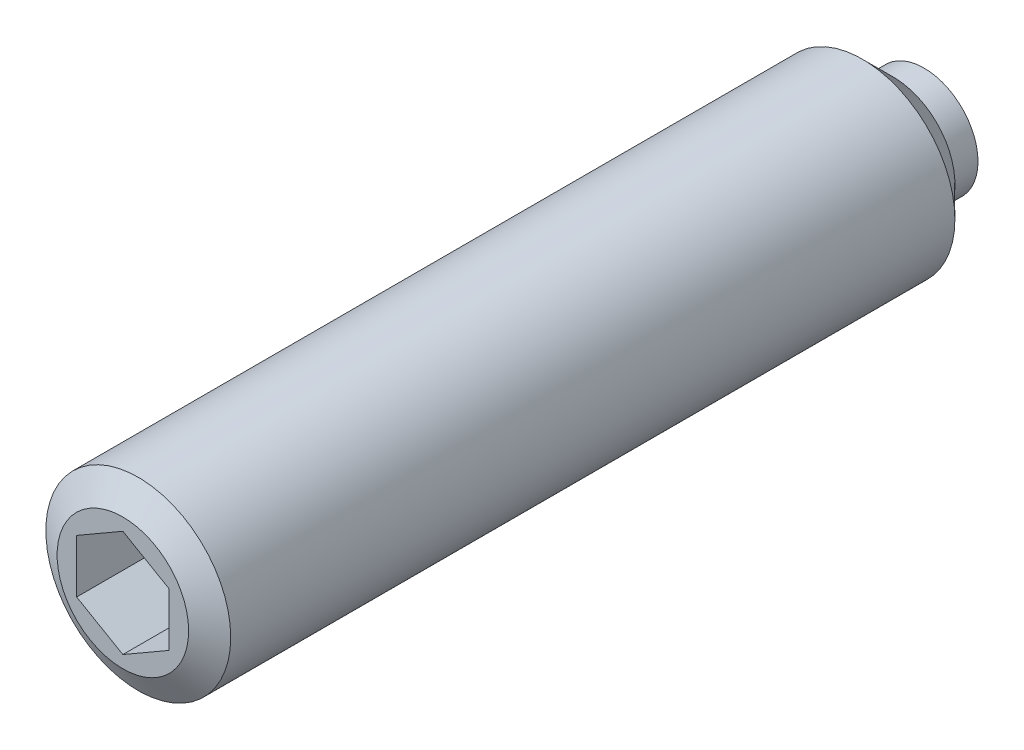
ISO-10303-21;
HEADER;
FILE_DESCRIPTION(('STEP AP214'),'2;1');
FILE_NAME('part.step','',(''),(''),'','','');
FILE_SCHEMA(('AUTOMOTIVE_DESIGN { 1 0 10303 214 1 1 1 1 }'));
ENDSEC;
DATA;
#1=APPLICATION_CONTEXT('core data for automotive mechanical design processes');
#2=APPLICATION_PROTOCOL_DEFINITION('international standard','automotive_design',2000,#1);
#3=PRODUCT_CONTEXT('',#1,'mechanical');
#4=PRODUCT('Part','Part','',(#3));
#5=PRODUCT_RELATED_PRODUCT_CATEGORY('part','',(#4));
#6=PRODUCT_DEFINITION_FORMATION('','',#4);
#7=PRODUCT_DEFINITION_CONTEXT('part definition',#1,'design');
#8=PRODUCT_DEFINITION('design','',#6,#7);
#9=PRODUCT_DEFINITION_SHAPE('','',#8);
#10=(LENGTH_UNIT() NAMED_UNIT(*) SI_UNIT(.MILLI.,.METRE.));
#11=(NAMED_UNIT(*) PLANE_ANGLE_UNIT() SI_UNIT($,.RADIAN.));
#12=(NAMED_UNIT(*) SI_UNIT($,.STERADIAN.) SOLID_ANGLE_UNIT());
#13=UNCERTAINTY_MEASURE_WITH_UNIT(LENGTH_MEASURE(1.E-05),#10,'distance_accuracy_value','');
#14=(GEOMETRIC_REPRESENTATION_CONTEXT(3) GLOBAL_UNCERTAINTY_ASSIGNED_CONTEXT((#13)) GLOBAL_UNIT_ASSIGNED_CONTEXT((#10,
#11,#12)) REPRESENTATION_CONTEXT('',''));
#15=CARTESIAN_POINT('',(0.,0.,0.));
#16=DIRECTION('',(0.,0.,1.));
#17=DIRECTION('',(1.,0.,0.));
#18=AXIS2_PLACEMENT_3D('',#15,#16,#17);
#19=CARTESIAN_POINT('',(3.5,0.,0.));
#20=DIRECTION('',(0.,0.,-1.));
#21=DIRECTION('',(-1.,0.,0.));
#22=AXIS2_PLACEMENT_3D('',#19,#20,#21);
#23=PLANE('',#22);
#24=CARTESIAN_POINT('',(0.,0.,0.));
#25=DIRECTION('',(0.,0.,1.));
#26=DIRECTION('',(1.,0.,0.));
#27=AXIS2_PLACEMENT_3D('',#24,#25,#26);
#28=CIRCLE('',#27,3.5);
#29=CARTESIAN_POINT('',(3.5,0.,0.));
#30=VERTEX_POINT('',#29);
#31=EDGE_CURVE('E124',#30,#30,#28,.T.);
#32=ORIENTED_EDGE('',*,*,#31,.F.);
#33=EDGE_LOOP('',(#32));
#34=FACE_BOUND('',#33,.T.);
#35=ADVANCED_FACE('F14',(#34),#23,.T.);
#36=CARTESIAN_POINT('',(0.,0.,72.));
#37=DIRECTION('',(0.,0.,1.));
#38=DIRECTION('',(1.,0.,0.));
#39=AXIS2_PLACEMENT_3D('',#36,#37,#38);
#40=CYLINDRICAL_SURFACE('',#39,3.5);
#41=CARTESIAN_POINT('',(0.,0.,2.));
#42=DIRECTION('',(0.,0.,1.));
#43=DIRECTION('',(1.,0.,0.));
#44=AXIS2_PLACEMENT_3D('',#41,#42,#43);
#45=CIRCLE('',#44,3.5);
#46=CARTESIAN_POINT('',(3.5,0.,2.));
#47=VERTEX_POINT('',#46);
#48=EDGE_CURVE('E121',#47,#47,#45,.T.);
#49=ORIENTED_EDGE('',*,*,#48,.F.);
#50=EDGE_LOOP('',(#49));
#51=FACE_BOUND('',#50,.T.);
#52=ORIENTED_EDGE('',*,*,#31,.T.);
#53=EDGE_LOOP('',(#52));
#54=FACE_BOUND('',#53,.T.);
#55=ADVANCED_FACE('F149',(#51,#54),#40,.T.);
#56=CARTESIAN_POINT('',(6.,0.,2.));
#57=DIRECTION('',(0.,0.,-1.));
#58=DIRECTION('',(-1.,0.,0.));
#59=AXIS2_PLACEMENT_3D('',#56,#57,#58);
#60=PLANE('',#59);
#61=CARTESIAN_POINT('',(0.,0.,2.));
#62=DIRECTION('',(0.,0.,-1.));
#63=DIRECTION('',(-1.,0.,0.));
#64=AXIS2_PLACEMENT_3D('',#61,#62,#63);
#65=CIRCLE('',#64,4.);
#66=CARTESIAN_POINT('',(-4.,0.,2.));
#67=VERTEX_POINT('',#66);
#68=EDGE_CURVE('E130',#67,#67,#65,.T.);
#69=ORIENTED_EDGE('',*,*,#68,.T.);
#70=EDGE_LOOP('',(#69));
#71=FACE_BOUND('',#70,.T.);
#72=ORIENTED_EDGE('',*,*,#48,.T.);
#73=EDGE_LOOP('',(#72));
#74=FACE_BOUND('',#73,.T.);
#75=ADVANCED_FACE('F155',(#71,#74),#60,.T.);
#76=CARTESIAN_POINT('',(0.,0.,72.));
#77=DIRECTION('',(0.,0.,1.));
#78=DIRECTION('',(1.,0.,0.));
#79=AXIS2_PLACEMENT_3D('',#76,#77,#78);
#80=CYLINDRICAL_SURFACE('',#79,6.);
#81=CARTESIAN_POINT('',(0.,0.,51.));
#82=DIRECTION('',(0.,0.,1.));
#83=DIRECTION('',(1.,0.,0.));
#84=AXIS2_PLACEMENT_3D('',#81,#82,#83);
#85=CIRCLE('',#84,6.);
#86=CARTESIAN_POINT('',(6.,0.,51.));
#87=VERTEX_POINT('',#86);
#88=EDGE_CURVE('E9',#87,#87,#85,.F.);
#89=ORIENTED_EDGE('',*,*,#88,.T.);
#90=EDGE_LOOP('',(#89));
#91=FACE_BOUND('',#90,.T.);
#92=CARTESIAN_POINT('',(0.,0.,4.));
#93=DIRECTION('',(0.,0.,-1.));
#94=DIRECTION('',(-1.,0.,0.));
#95=AXIS2_PLACEMENT_3D('',#92,#93,#94);
#96=CIRCLE('',#95,6.);
#97=CARTESIAN_POINT('',(-6.,0.,4.));
#98=VERTEX_POINT('',#97);
#99=EDGE_CURVE('E127',#98,#98,#96,.F.);
#100=ORIENTED_EDGE('',*,*,#99,.T.);
#101=EDGE_LOOP('',(#100));
#102=FACE_BOUND('',#101,.T.);
#103=ADVANCED_FACE('F162',(#91,#102),#80,.T.);
#104=CARTESIAN_POINT('',(0.,0.,52.));
#105=DIRECTION('',(0.,0.,1.));
#106=DIRECTION('',(1.,0.,0.));
#107=AXIS2_PLACEMENT_3D('',#104,#105,#106);
#108=PLANE('',#107);
#109=CARTESIAN_POINT('',(0.,0.,52.));
#110=DIRECTION('',(0.,0.,1.));
#111=DIRECTION('',(1.,0.,0.));
#112=AXIS2_PLACEMENT_3D('',#109,#110,#111);
#113=CIRCLE('',#112,4.26794919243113);
#114=CARTESIAN_POINT('',(4.26794919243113,0.,52.));
#115=VERTEX_POINT('',#114);
#116=EDGE_CURVE('E22',#115,#115,#113,.T.);
#117=ORIENTED_EDGE('',*,*,#116,.T.);
#118=EDGE_LOOP('',(#117));
#119=FACE_BOUND('',#118,.T.);
#120=DIRECTION('',(0.86602540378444,-0.5,0.));
#121=VECTOR('',#120,1.);
#122=CARTESIAN_POINT('',(-3.,-1.73205080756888,52.));
#123=LINE('',#122,#121);
#124=CARTESIAN_POINT('',(-3.,-1.73205080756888,52.));
#125=VERTEX_POINT('',#124);
#126=CARTESIAN_POINT('',(0.,-3.46410161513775,52.));
#127=VERTEX_POINT('',#126);
#128=EDGE_CURVE('E29',#125,#127,#123,.T.);
#129=ORIENTED_EDGE('',*,*,#128,.F.);
#130=DIRECTION('',(0.,-1.,0.));
#131=VECTOR('',#130,1.);
#132=CARTESIAN_POINT('',(-3.,1.73205080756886,52.));
#133=LINE('',#132,#131);
#134=CARTESIAN_POINT('',(-3.,1.73205080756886,52.));
#135=VERTEX_POINT('',#134);
#136=EDGE_CURVE('E97',#135,#125,#133,.T.);
#137=ORIENTED_EDGE('',*,*,#136,.F.);
#138=DIRECTION('',(0.866025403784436,0.5,0.));
#139=VECTOR('',#138,1.);
#140=CARTESIAN_POINT('',(-3.,1.73205080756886,52.));
#141=LINE('',#140,#139);
#142=CARTESIAN_POINT('',(0.,3.46410161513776,52.));
#143=VERTEX_POINT('',#142);
#144=EDGE_CURVE('E92',#135,#143,#141,.T.);
#145=ORIENTED_EDGE('',*,*,#144,.T.);
#146=DIRECTION('',(-0.866025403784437,0.5,0.));
#147=VECTOR('',#146,1.);
#148=CARTESIAN_POINT('',(3.,1.73205080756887,52.));
#149=LINE('',#148,#147);
#150=CARTESIAN_POINT('',(3.,1.73205080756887,52.));
#151=VERTEX_POINT('',#150);
#152=EDGE_CURVE('E90',#151,#143,#149,.T.);
#153=ORIENTED_EDGE('',*,*,#152,.F.);
#154=DIRECTION('',(0.,-1.,0.));
#155=VECTOR('',#154,1.);
#156=CARTESIAN_POINT('',(3.,1.73205080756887,52.));
#157=LINE('',#156,#155);
#158=CARTESIAN_POINT('',(3.,-1.73205080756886,52.));
#159=VERTEX_POINT('',#158);
#160=EDGE_CURVE('E72',#151,#159,#157,.T.);
#161=ORIENTED_EDGE('',*,*,#160,.T.);
#162=DIRECTION('',(-0.866025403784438,-0.5,0.));
#163=VECTOR('',#162,1.);
#164=CARTESIAN_POINT('',(3.,-1.73205080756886,52.));
#165=LINE('',#164,#163);
#166=EDGE_CURVE('E83',#159,#127,#165,.T.);
#167=ORIENTED_EDGE('',*,*,#166,.T.);
#168=EDGE_LOOP('',(#129,#137,#145,#153,#161,#167));
#169=FACE_BOUND('',#168,.T.);
#170=ADVANCED_FACE('F87',(#119,#169),#108,.T.);
#171=CARTESIAN_POINT('',(-3.,-1.73205080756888,47.));
#172=DIRECTION('',(-0.5,-0.86602540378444,0.));
#173=DIRECTION('',(-0.86602540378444,0.5,0.));
#174=AXIS2_PLACEMENT_3D('',#171,#172,#173);
#175=PLANE('',#174);
#176=DIRECTION('',(0.,0.,1.));
#177=VECTOR('',#176,1.);
#178=CARTESIAN_POINT('',(-3.,-1.73205080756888,47.));
#179=LINE('',#178,#177);
#180=CARTESIAN_POINT('',(-3.,-1.73205080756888,47.));
#181=VERTEX_POINT('',#180);
#182=EDGE_CURVE('E36',#181,#125,#179,.T.);
#183=ORIENTED_EDGE('',*,*,#182,.T.);
#184=ORIENTED_EDGE('',*,*,#128,.T.);
#185=DIRECTION('',(0.,0.,1.));
#186=VECTOR('',#185,1.);
#187=CARTESIAN_POINT('',(0.,-3.46410161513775,47.));
#188=LINE('',#187,#186);
#189=CARTESIAN_POINT('',(0.,-3.46410161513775,47.));
#190=VERTEX_POINT('',#189);
#191=EDGE_CURVE('E80',#190,#127,#188,.T.);
#192=ORIENTED_EDGE('',*,*,#191,.F.);
#193=DIRECTION('',(0.86602540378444,-0.5,0.));
#194=VECTOR('',#193,1.);
#195=CARTESIAN_POINT('',(-3.,-1.73205080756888,47.));
#196=LINE('',#195,#194);
#197=EDGE_CURVE('E99',#181,#190,#196,.T.);
#198=ORIENTED_EDGE('',*,*,#197,.F.);
#199=EDGE_LOOP('',(#183,#184,#192,#198));
#200=FACE_BOUND('',#199,.T.);
#201=ADVANCED_FACE('F169',(#200),#175,.F.);
#202=CARTESIAN_POINT('',(-3.,1.73205080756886,47.));
#203=DIRECTION('',(-1.,0.,0.));
#204=DIRECTION('',(0.,1.,0.));
#205=AXIS2_PLACEMENT_3D('',#202,#203,#204);
#206=PLANE('',#205);
#207=DIRECTION('',(0.,0.,1.));
#208=VECTOR('',#207,1.);
#209=CARTESIAN_POINT('',(-3.,1.73205080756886,47.));
#210=LINE('',#209,#208);
#211=CARTESIAN_POINT('',(-3.,1.73205080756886,47.));
#212=VERTEX_POINT('',#211);
#213=EDGE_CURVE('E118',#212,#135,#210,.T.);
#214=ORIENTED_EDGE('',*,*,#213,.T.);
#215=ORIENTED_EDGE('',*,*,#136,.T.);
#216=ORIENTED_EDGE('',*,*,#182,.F.);
#217=DIRECTION('',(0.,-1.,0.));
#218=VECTOR('',#217,1.);
#219=CARTESIAN_POINT('',(-3.,1.73205080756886,47.));
#220=LINE('',#219,#218);
#221=EDGE_CURVE('E111',#212,#181,#220,.T.);
#222=ORIENTED_EDGE('',*,*,#221,.F.);
#223=EDGE_LOOP('',(#214,#215,#216,#222));
#224=FACE_BOUND('',#223,.T.);
#225=ADVANCED_FACE('F170',(#224),#206,.F.);
#226=CARTESIAN_POINT('',(-3.,1.73205080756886,47.));
#227=DIRECTION('',(0.5,-0.866025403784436,0.));
#228=DIRECTION('',(-0.866025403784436,-0.5,0.));
#229=AXIS2_PLACEMENT_3D('',#226,#227,#228);
#230=PLANE('',#229);
#231=DIRECTION('',(0.,0.,1.));
#232=VECTOR('',#231,1.);
#233=CARTESIAN_POINT('',(0.,3.46410161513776,47.));
#234=LINE('',#233,#232);
#235=CARTESIAN_POINT('',(0.,3.46410161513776,47.));
#236=VERTEX_POINT('',#235);
#237=EDGE_CURVE('E116',#236,#143,#234,.T.);
#238=ORIENTED_EDGE('',*,*,#237,.T.);
#239=ORIENTED_EDGE('',*,*,#144,.F.);
#240=ORIENTED_EDGE('',*,*,#213,.F.);
#241=DIRECTION('',(0.866025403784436,0.5,0.));
#242=VECTOR('',#241,1.);
#243=CARTESIAN_POINT('',(-3.,1.73205080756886,47.));
#244=LINE('',#243,#242);
#245=EDGE_CURVE('E108',#212,#236,#244,.T.);
#246=ORIENTED_EDGE('',*,*,#245,.T.);
#247=EDGE_LOOP('',(#238,#239,#240,#246));
#248=FACE_BOUND('',#247,.T.);
#249=ADVANCED_FACE('F173',(#248),#230,.T.);
#250=CARTESIAN_POINT('',(3.,1.73205080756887,47.));
#251=DIRECTION('',(0.5,0.866025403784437,0.));
#252=DIRECTION('',(0.866025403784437,-0.5,0.));
#253=AXIS2_PLACEMENT_3D('',#250,#251,#252);
#254=PLANE('',#253);
#255=DIRECTION('',(0.,0.,1.));
#256=VECTOR('',#255,1.);
#257=CARTESIAN_POINT('',(3.,1.73205080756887,47.));
#258=LINE('',#257,#256);
#259=CARTESIAN_POINT('',(3.,1.73205080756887,47.));
#260=VERTEX_POINT('',#259);
#261=EDGE_CURVE('E79',#260,#151,#258,.T.);
#262=ORIENTED_EDGE('',*,*,#261,.T.);
#263=ORIENTED_EDGE('',*,*,#152,.T.);
#264=ORIENTED_EDGE('',*,*,#237,.F.);
#265=DIRECTION('',(-0.866025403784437,0.5,0.));
#266=VECTOR('',#265,1.);
#267=CARTESIAN_POINT('',(3.,1.73205080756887,47.));
#268=LINE('',#267,#266);
#269=EDGE_CURVE('E105',#260,#236,#268,.T.);
#270=ORIENTED_EDGE('',*,*,#269,.F.);
#271=EDGE_LOOP('',(#262,#263,#264,#270));
#272=FACE_BOUND('',#271,.T.);
#273=ADVANCED_FACE('F176',(#272),#254,.F.);
#274=CARTESIAN_POINT('',(3.,1.73205080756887,47.));
#275=DIRECTION('',(-1.,0.,0.));
#276=DIRECTION('',(0.,1.,0.));
#277=AXIS2_PLACEMENT_3D('',#274,#275,#276);
#278=PLANE('',#277);
#279=DIRECTION('',(0.,0.,1.));
#280=VECTOR('',#279,1.);
#281=CARTESIAN_POINT('',(3.,-1.73205080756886,47.));
#282=LINE('',#281,#280);
#283=CARTESIAN_POINT('',(3.,-1.73205080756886,47.));
#284=VERTEX_POINT('',#283);
#285=EDGE_CURVE('E68',#284,#159,#282,.T.);
#286=ORIENTED_EDGE('',*,*,#285,.T.);
#287=ORIENTED_EDGE('',*,*,#160,.F.);
#288=ORIENTED_EDGE('',*,*,#261,.F.);
#289=DIRECTION('',(0.,-1.,0.));
#290=VECTOR('',#289,1.);
#291=CARTESIAN_POINT('',(3.,1.73205080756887,47.));
#292=LINE('',#291,#290);
#293=EDGE_CURVE('E75',#260,#284,#292,.T.);
#294=ORIENTED_EDGE('',*,*,#293,.T.);
#295=EDGE_LOOP('',(#286,#287,#288,#294));
#296=FACE_BOUND('',#295,.T.);
#297=ADVANCED_FACE('F70',(#296),#278,.T.);
#298=CARTESIAN_POINT('',(3.,-1.73205080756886,47.));
#299=DIRECTION('',(-0.5,0.866025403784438,0.));
#300=DIRECTION('',(0.866025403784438,0.5,0.));
#301=AXIS2_PLACEMENT_3D('',#298,#299,#300);
#302=PLANE('',#301);
#303=DIRECTION('',(-0.866025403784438,-0.5,0.));
#304=VECTOR('',#303,1.);
#305=CARTESIAN_POINT('',(3.,-1.73205080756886,47.));
#306=LINE('',#305,#304);
#307=EDGE_CURVE('E102',#284,#190,#306,.T.);
#308=ORIENTED_EDGE('',*,*,#307,.T.);
#309=ORIENTED_EDGE('',*,*,#191,.T.);
#310=ORIENTED_EDGE('',*,*,#166,.F.);
#311=ORIENTED_EDGE('',*,*,#285,.F.);
#312=EDGE_LOOP('',(#308,#309,#310,#311));
#313=FACE_BOUND('',#312,.T.);
#314=ADVANCED_FACE('F84',(#313),#302,.T.);
#315=CARTESIAN_POINT('',(-6.,0.,47.));
#316=DIRECTION('',(0.,0.,1.));
#317=DIRECTION('',(1.,0.,0.));
#318=AXIS2_PLACEMENT_3D('',#315,#316,#317);
#319=PLANE('',#318);
#320=ORIENTED_EDGE('',*,*,#197,.T.);
#321=ORIENTED_EDGE('',*,*,#307,.F.);
#322=ORIENTED_EDGE('',*,*,#293,.F.);
#323=ORIENTED_EDGE('',*,*,#269,.T.);
#324=ORIENTED_EDGE('',*,*,#245,.F.);
#325=ORIENTED_EDGE('',*,*,#221,.T.);
#326=EDGE_LOOP('',(#320,#321,#322,#323,#324,#325));
#327=FACE_BOUND('',#326,.T.);
#328=ADVANCED_FACE('F144',(#327),#319,.T.);
#329=CARTESIAN_POINT('',(0.,0.,4.));
#330=DIRECTION('',(0.,0.,1.));
#331=DIRECTION('',(1.,0.,0.));
#332=AXIS2_PLACEMENT_3D('',#329,#330,#331);
#333=CONICAL_SURFACE('',#332,6.,0.785398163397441);
#334=ORIENTED_EDGE('',*,*,#68,.F.);
#335=EDGE_LOOP('',(#334));
#336=FACE_BOUND('',#335,.T.);
#337=ORIENTED_EDGE('',*,*,#99,.F.);
#338=EDGE_LOOP('',(#337));
#339=FACE_BOUND('',#338,.T.);
#340=ADVANCED_FACE('F137',(#336,#339),#333,.T.);
#341=CARTESIAN_POINT('',(0.,0.,52.));
#342=DIRECTION('',(0.,0.,-1.));
#343=DIRECTION('',(-1.,0.,0.));
#344=AXIS2_PLACEMENT_3D('',#341,#342,#343);
#345=CONICAL_SURFACE('',#344,4.26794919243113,1.0471975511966);
#346=ORIENTED_EDGE('',*,*,#88,.F.);
#347=EDGE_LOOP('',(#346));
#348=FACE_BOUND('',#347,.T.);
#349=ORIENTED_EDGE('',*,*,#116,.F.);
#350=EDGE_LOOP('',(#349));
#351=FACE_BOUND('',#350,.T.);
#352=ADVANCED_FACE('F16',(#348,#351),#345,.T.);
#353=CLOSED_SHELL('',(#35,#55,#75,#103,#170,#201,#225,#249,#273,#297,#314,#328,#340,#352));
#354=MANIFOLD_SOLID_BREP('B1',#353);
#355=ADVANCED_BREP_SHAPE_REPRESENTATION('',(#18,#354),#14);
#356=SHAPE_DEFINITION_REPRESENTATION(#9,#355);
ENDSEC;
END-ISO-10303-21;
